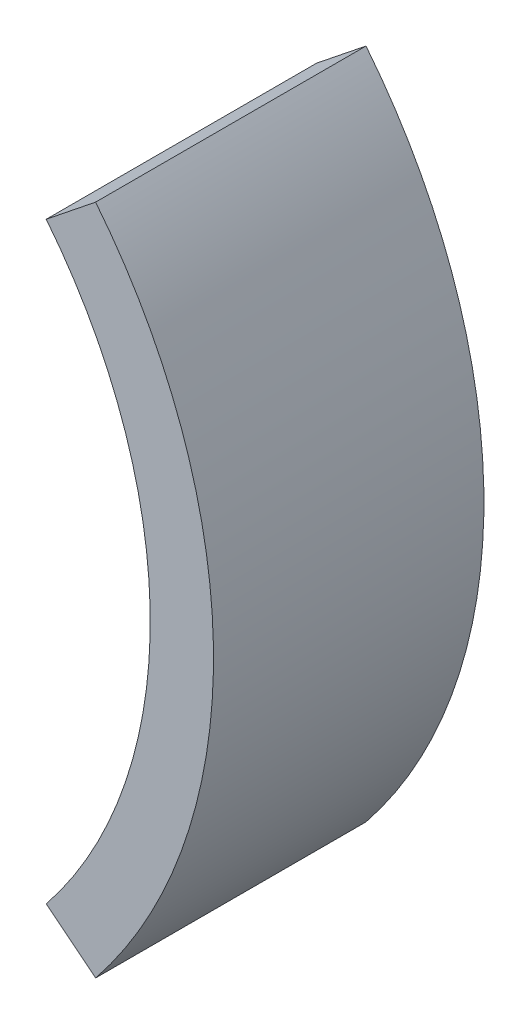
ISO-10303-21;
HEADER;
FILE_DESCRIPTION(('STEP AP214'),'2;1');
FILE_NAME('part.step','',(''),(''),'','','');
FILE_SCHEMA(('AUTOMOTIVE_DESIGN { 1 0 10303 214 1 1 1 1 }'));
ENDSEC;
DATA;
#1=APPLICATION_CONTEXT('core data for automotive mechanical design processes');
#2=APPLICATION_PROTOCOL_DEFINITION('international standard','automotive_design',2000,#1);
#3=PRODUCT_CONTEXT('',#1,'mechanical');
#4=PRODUCT('Part','Part','',(#3));
#5=PRODUCT_RELATED_PRODUCT_CATEGORY('part','',(#4));
#6=PRODUCT_DEFINITION_FORMATION('','',#4);
#7=PRODUCT_DEFINITION_CONTEXT('part definition',#1,'design');
#8=PRODUCT_DEFINITION('design','',#6,#7);
#9=PRODUCT_DEFINITION_SHAPE('','',#8);
#10=(LENGTH_UNIT() NAMED_UNIT(*) SI_UNIT(.MILLI.,.METRE.));
#11=(NAMED_UNIT(*) PLANE_ANGLE_UNIT() SI_UNIT($,.RADIAN.));
#12=(NAMED_UNIT(*) SI_UNIT($,.STERADIAN.) SOLID_ANGLE_UNIT());
#13=UNCERTAINTY_MEASURE_WITH_UNIT(LENGTH_MEASURE(1.E-05),#10,'distance_accuracy_value','');
#14=(GEOMETRIC_REPRESENTATION_CONTEXT(3) GLOBAL_UNCERTAINTY_ASSIGNED_CONTEXT((#13)) GLOBAL_UNIT_ASSIGNED_CONTEXT((#10,
#11,#12)) REPRESENTATION_CONTEXT('',''));
#15=CARTESIAN_POINT('',(0.,0.,0.));
#16=DIRECTION('',(0.,0.,1.));
#17=DIRECTION('',(1.,0.,0.));
#18=AXIS2_PLACEMENT_3D('',#15,#16,#17);
#19=CARTESIAN_POINT('',(0.,0.,8.55));
#20=DIRECTION('',(0.,0.,-1.));
#21=DIRECTION('',(-1.,0.,0.));
#22=AXIS2_PLACEMENT_3D('',#19,#20,#21);
#23=CYLINDRICAL_SURFACE('',#22,30.);
#24=CARTESIAN_POINT('',(0.,0.,-8.55));
#25=DIRECTION('',(0.,0.,-1.));
#26=DIRECTION('',(-1.,0.,0.));
#27=AXIS2_PLACEMENT_3D('',#24,#25,#26);
#28=CIRCLE('',#27,30.);
#29=CARTESIAN_POINT('',(23.4212085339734,18.746919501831,-8.55));
#30=VERTEX_POINT('',#29);
#31=CARTESIAN_POINT('',(23.4212085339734,-18.746919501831,-8.55));
#32=VERTEX_POINT('',#31);
#33=EDGE_CURVE('E102',#30,#32,#28,.T.);
#34=ORIENTED_EDGE('',*,*,#33,.T.);
#35=DIRECTION('',(0.,0.,-1.));
#36=VECTOR('',#35,1.);
#37=CARTESIAN_POINT('',(23.4212085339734,-18.746919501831,8.55));
#38=LINE('',#37,#36);
#39=CARTESIAN_POINT('',(23.4212085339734,-18.746919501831,8.55));
#40=VERTEX_POINT('',#39);
#41=EDGE_CURVE('E11',#40,#32,#38,.T.);
#42=ORIENTED_EDGE('',*,*,#41,.F.);
#43=CARTESIAN_POINT('',(0.,0.,8.55));
#44=DIRECTION('',(0.,0.,-1.));
#45=DIRECTION('',(-1.,0.,0.));
#46=AXIS2_PLACEMENT_3D('',#43,#44,#45);
#47=CIRCLE('',#46,30.);
#48=CARTESIAN_POINT('',(23.4212085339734,18.746919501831,8.55));
#49=VERTEX_POINT('',#48);
#50=EDGE_CURVE('E79',#49,#40,#47,.T.);
#51=ORIENTED_EDGE('',*,*,#50,.F.);
#52=DIRECTION('',(0.,0.,-1.));
#53=VECTOR('',#52,1.);
#54=CARTESIAN_POINT('',(23.4212085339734,18.746919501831,8.55));
#55=LINE('',#54,#53);
#56=EDGE_CURVE('E55',#49,#30,#55,.T.);
#57=ORIENTED_EDGE('',*,*,#56,.T.);
#58=EDGE_LOOP('',(#34,#42,#51,#57));
#59=FACE_BOUND('',#58,.T.);
#60=ADVANCED_FACE('F39',(#59),#23,.F.);
#61=CARTESIAN_POINT('',(26.5440363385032,-21.2465087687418,8.55));
#62=DIRECTION('',(-0.624897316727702,-0.780706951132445,0.));
#63=DIRECTION('',(0.780706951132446,-0.624897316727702,0.));
#64=AXIS2_PLACEMENT_3D('',#61,#62,#63);
#65=PLANE('',#64);
#66=DIRECTION('',(-0.780706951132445,0.624897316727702,0.));
#67=VECTOR('',#66,1.);
#68=CARTESIAN_POINT('',(26.5440363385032,-21.2465087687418,-8.55));
#69=LINE('',#68,#67);
#70=CARTESIAN_POINT('',(26.5440363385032,-21.2465087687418,-8.55));
#71=VERTEX_POINT('',#70);
#72=EDGE_CURVE('E88',#71,#32,#69,.T.);
#73=ORIENTED_EDGE('',*,*,#72,.F.);
#74=DIRECTION('',(0.,0.,-1.));
#75=VECTOR('',#74,1.);
#76=CARTESIAN_POINT('',(26.5440363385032,-21.2465087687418,8.55));
#77=LINE('',#76,#75);
#78=CARTESIAN_POINT('',(26.5440363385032,-21.2465087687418,8.55));
#79=VERTEX_POINT('',#78);
#80=EDGE_CURVE('E47',#79,#71,#77,.T.);
#81=ORIENTED_EDGE('',*,*,#80,.F.);
#82=DIRECTION('',(-0.780706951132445,0.624897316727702,0.));
#83=VECTOR('',#82,1.);
#84=CARTESIAN_POINT('',(26.5440363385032,-21.2465087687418,8.55));
#85=LINE('',#84,#83);
#86=EDGE_CURVE('E86',#79,#40,#85,.T.);
#87=ORIENTED_EDGE('',*,*,#86,.T.);
#88=ORIENTED_EDGE('',*,*,#41,.T.);
#89=EDGE_LOOP('',(#73,#81,#87,#88));
#90=FACE_BOUND('',#89,.T.);
#91=ADVANCED_FACE('F85',(#90),#65,.T.);
#92=CARTESIAN_POINT('',(0.,0.,8.55));
#93=DIRECTION('',(0.,0.,-1.));
#94=DIRECTION('',(-1.,0.,0.));
#95=AXIS2_PLACEMENT_3D('',#92,#93,#94);
#96=CYLINDRICAL_SURFACE('',#95,34.);
#97=CARTESIAN_POINT('',(0.,0.,-8.55));
#98=DIRECTION('',(0.,0.,1.));
#99=DIRECTION('',(1.,0.,0.));
#100=AXIS2_PLACEMENT_3D('',#97,#98,#99);
#101=CIRCLE('',#100,34.);
#102=CARTESIAN_POINT('',(26.5440363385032,21.2465087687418,-8.55));
#103=VERTEX_POINT('',#102);
#104=EDGE_CURVE('E105',#103,#71,#101,.F.);
#105=ORIENTED_EDGE('',*,*,#104,.F.);
#106=DIRECTION('',(0.,0.,-1.));
#107=VECTOR('',#106,1.);
#108=CARTESIAN_POINT('',(26.5440363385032,21.2465087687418,8.55));
#109=LINE('',#108,#107);
#110=CARTESIAN_POINT('',(26.5440363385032,21.2465087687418,8.55));
#111=VERTEX_POINT('',#110);
#112=EDGE_CURVE('E68',#111,#103,#109,.T.);
#113=ORIENTED_EDGE('',*,*,#112,.F.);
#114=CARTESIAN_POINT('',(0.,0.,8.55));
#115=DIRECTION('',(0.,0.,1.));
#116=DIRECTION('',(1.,0.,0.));
#117=AXIS2_PLACEMENT_3D('',#114,#115,#116);
#118=CIRCLE('',#117,34.);
#119=EDGE_CURVE('E94',#111,#79,#118,.F.);
#120=ORIENTED_EDGE('',*,*,#119,.T.);
#121=ORIENTED_EDGE('',*,*,#80,.T.);
#122=EDGE_LOOP('',(#105,#113,#120,#121));
#123=FACE_BOUND('',#122,.T.);
#124=ADVANCED_FACE('F96',(#123),#96,.T.);
#125=CARTESIAN_POINT('',(23.4212085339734,18.746919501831,8.55));
#126=DIRECTION('',(-0.6248973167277,0.780706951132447,0.));
#127=DIRECTION('',(-0.780706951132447,-0.6248973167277,0.));
#128=AXIS2_PLACEMENT_3D('',#125,#126,#127);
#129=PLANE('',#128);
#130=DIRECTION('',(0.780706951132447,0.6248973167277,0.));
#131=VECTOR('',#130,1.);
#132=CARTESIAN_POINT('',(23.4212085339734,18.746919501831,-8.55));
#133=LINE('',#132,#131);
#134=EDGE_CURVE('E107',#30,#103,#133,.T.);
#135=ORIENTED_EDGE('',*,*,#134,.F.);
#136=ORIENTED_EDGE('',*,*,#56,.F.);
#137=DIRECTION('',(0.780706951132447,0.6248973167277,0.));
#138=VECTOR('',#137,1.);
#139=CARTESIAN_POINT('',(23.4212085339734,18.746919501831,8.55));
#140=LINE('',#139,#138);
#141=EDGE_CURVE('E97',#49,#111,#140,.T.);
#142=ORIENTED_EDGE('',*,*,#141,.T.);
#143=ORIENTED_EDGE('',*,*,#112,.T.);
#144=EDGE_LOOP('',(#135,#136,#142,#143));
#145=FACE_BOUND('',#144,.T.);
#146=ADVANCED_FACE('F113',(#145),#129,.T.);
#147=CARTESIAN_POINT('',(0.,0.,8.55));
#148=DIRECTION('',(0.,0.,-1.));
#149=DIRECTION('',(-1.,0.,0.));
#150=AXIS2_PLACEMENT_3D('',#147,#148,#149);
#151=PLANE('',#150);
#152=ORIENTED_EDGE('',*,*,#50,.T.);
#153=ORIENTED_EDGE('',*,*,#86,.F.);
#154=ORIENTED_EDGE('',*,*,#119,.F.);
#155=ORIENTED_EDGE('',*,*,#141,.F.);
#156=EDGE_LOOP('',(#152,#153,#154,#155));
#157=FACE_BOUND('',#156,.T.);
#158=ADVANCED_FACE('F93',(#157),#151,.F.);
#159=CARTESIAN_POINT('',(0.,0.,-8.55));
#160=DIRECTION('',(0.,0.,-1.));
#161=DIRECTION('',(-1.,0.,0.));
#162=AXIS2_PLACEMENT_3D('',#159,#160,#161);
#163=PLANE('',#162);
#164=ORIENTED_EDGE('',*,*,#33,.F.);
#165=ORIENTED_EDGE('',*,*,#134,.T.);
#166=ORIENTED_EDGE('',*,*,#104,.T.);
#167=ORIENTED_EDGE('',*,*,#72,.T.);
#168=EDGE_LOOP('',(#164,#165,#166,#167));
#169=FACE_BOUND('',#168,.T.);
#170=ADVANCED_FACE('F112',(#169),#163,.T.);
#171=CLOSED_SHELL('',(#60,#91,#124,#146,#158,#170));
#172=MANIFOLD_SOLID_BREP('B2',#171);
#173=ADVANCED_BREP_SHAPE_REPRESENTATION('',(#18,#172),#14);
#174=SHAPE_DEFINITION_REPRESENTATION(#9,#173);
ENDSEC;
END-ISO-10303-21;
